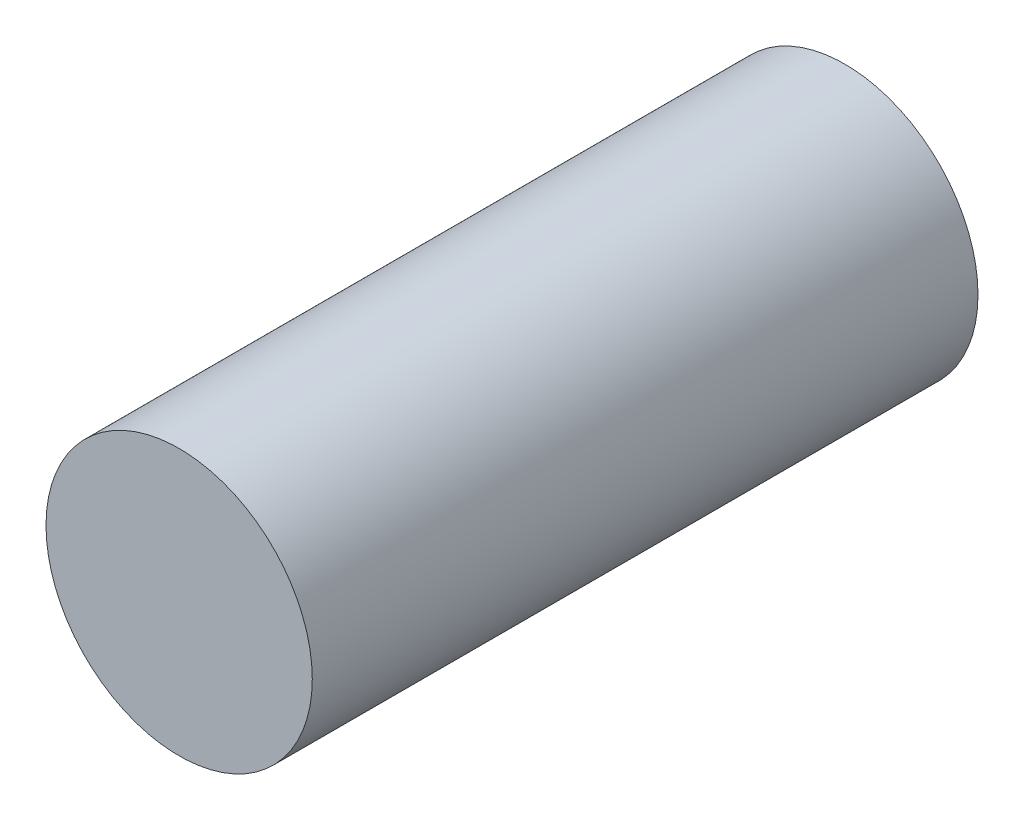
from build123d import *

# Parameters (mm, degrees)
SKIZZE1_R                       = 20
AUFSATZ_LINEAR_AUSTRAGEN1_DEPTH = 100


with BuildPart() as part:
    # Skizze1 → Aufsatz-Linear austragen1 (new body)
    with BuildSketch(Plane.XY):
        Circle(SKIZZE1_R)
    extrude(amount=AUFSATZ_LINEAR_AUSTRAGEN1_DEPTH)


solid = part.part
